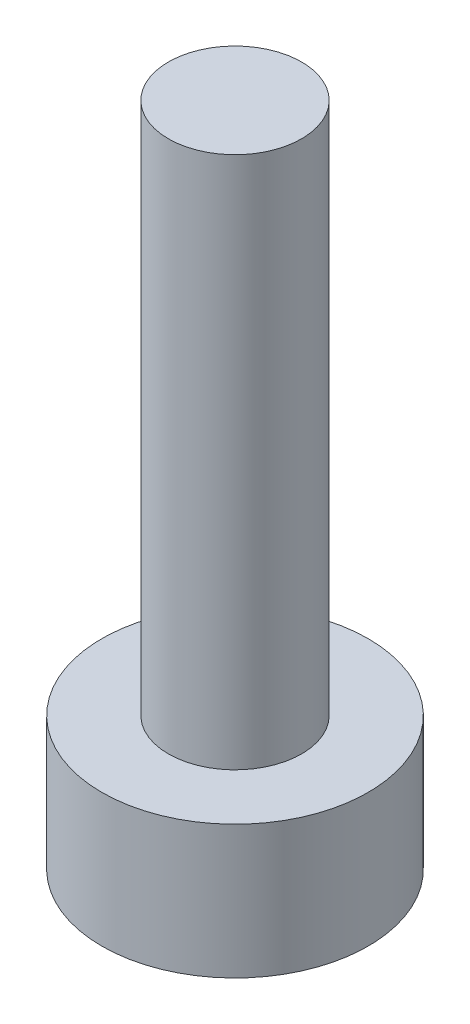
ISO-10303-21;
HEADER;
FILE_DESCRIPTION(('STEP AP214'),'2;1');
FILE_NAME('part.step','',(''),(''),'','','');
FILE_SCHEMA(('AUTOMOTIVE_DESIGN { 1 0 10303 214 1 1 1 1 }'));
ENDSEC;
DATA;
#1=APPLICATION_CONTEXT('core data for automotive mechanical design processes');
#2=APPLICATION_PROTOCOL_DEFINITION('international standard','automotive_design',2000,#1);
#3=PRODUCT_CONTEXT('',#1,'mechanical');
#4=PRODUCT('Part','Part','',(#3));
#5=PRODUCT_RELATED_PRODUCT_CATEGORY('part','',(#4));
#6=PRODUCT_DEFINITION_FORMATION('','',#4);
#7=PRODUCT_DEFINITION_CONTEXT('part definition',#1,'design');
#8=PRODUCT_DEFINITION('design','',#6,#7);
#9=PRODUCT_DEFINITION_SHAPE('','',#8);
#10=(LENGTH_UNIT() NAMED_UNIT(*) SI_UNIT(.MILLI.,.METRE.));
#11=(NAMED_UNIT(*) PLANE_ANGLE_UNIT() SI_UNIT($,.RADIAN.));
#12=(NAMED_UNIT(*) SI_UNIT($,.STERADIAN.) SOLID_ANGLE_UNIT());
#13=UNCERTAINTY_MEASURE_WITH_UNIT(LENGTH_MEASURE(1.E-05),#10,'distance_accuracy_value','');
#14=(GEOMETRIC_REPRESENTATION_CONTEXT(3) GLOBAL_UNCERTAINTY_ASSIGNED_CONTEXT((#13)) GLOBAL_UNIT_ASSIGNED_CONTEXT((#10,
#11,#12)) REPRESENTATION_CONTEXT('',''));
#15=CARTESIAN_POINT('',(0.,0.,0.));
#16=DIRECTION('',(0.,0.,1.));
#17=DIRECTION('',(1.,0.,0.));
#18=AXIS2_PLACEMENT_3D('',#15,#16,#17);
#19=CARTESIAN_POINT('',(-1.99999999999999,20.,0.));
#20=DIRECTION('',(0.,1.,0.));
#21=DIRECTION('',(0.,0.,1.));
#22=AXIS2_PLACEMENT_3D('',#19,#20,#21);
#23=PLANE('',#22);
#24=CARTESIAN_POINT('',(0.,20.,0.));
#25=DIRECTION('',(0.,1.,0.));
#26=DIRECTION('',(0.,0.,1.));
#27=AXIS2_PLACEMENT_3D('',#24,#25,#26);
#28=CIRCLE('',#27,1.99999999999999);
#29=CARTESIAN_POINT('',(0.,20.,1.99999999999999));
#30=VERTEX_POINT('',#29);
#31=EDGE_CURVE('E10',#30,#30,#28,.T.);
#32=ORIENTED_EDGE('',*,*,#31,.T.);
#33=EDGE_LOOP('',(#32));
#34=FACE_BOUND('',#33,.T.);
#35=ADVANCED_FACE('F30',(#34),#23,.T.);
#36=CARTESIAN_POINT('',(0.,49.4323076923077,0.));
#37=DIRECTION('',(0.,1.,0.));
#38=DIRECTION('',(0.,0.,1.));
#39=AXIS2_PLACEMENT_3D('',#36,#37,#38);
#40=CYLINDRICAL_SURFACE('',#39,1.99999999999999);
#41=CARTESIAN_POINT('',(0.,4.,0.));
#42=DIRECTION('',(0.,1.,0.));
#43=DIRECTION('',(0.,0.,1.));
#44=AXIS2_PLACEMENT_3D('',#41,#42,#43);
#45=CIRCLE('',#44,1.99999999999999);
#46=CARTESIAN_POINT('',(0.,4.,1.99999999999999));
#47=VERTEX_POINT('',#46);
#48=EDGE_CURVE('E36',#47,#47,#45,.T.);
#49=ORIENTED_EDGE('',*,*,#48,.T.);
#50=EDGE_LOOP('',(#49));
#51=FACE_BOUND('',#50,.T.);
#52=ORIENTED_EDGE('',*,*,#31,.F.);
#53=EDGE_LOOP('',(#52));
#54=FACE_BOUND('',#53,.T.);
#55=ADVANCED_FACE('F62',(#51,#54),#40,.T.);
#56=CARTESIAN_POINT('',(-3.99999999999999,4.,0.));
#57=DIRECTION('',(0.,1.,0.));
#58=DIRECTION('',(0.,0.,1.));
#59=AXIS2_PLACEMENT_3D('',#56,#57,#58);
#60=PLANE('',#59);
#61=CARTESIAN_POINT('',(0.,4.,0.));
#62=DIRECTION('',(0.,1.,0.));
#63=DIRECTION('',(0.,0.,1.));
#64=AXIS2_PLACEMENT_3D('',#61,#62,#63);
#65=CIRCLE('',#64,3.99999999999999);
#66=CARTESIAN_POINT('',(0.,4.,3.99999999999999));
#67=VERTEX_POINT('',#66);
#68=EDGE_CURVE('E40',#67,#67,#65,.T.);
#69=ORIENTED_EDGE('',*,*,#68,.T.);
#70=EDGE_LOOP('',(#69));
#71=FACE_BOUND('',#70,.T.);
#72=ORIENTED_EDGE('',*,*,#48,.F.);
#73=EDGE_LOOP('',(#72));
#74=FACE_BOUND('',#73,.T.);
#75=ADVANCED_FACE('F59',(#71,#74),#60,.T.);
#76=CARTESIAN_POINT('',(0.,49.4323076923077,0.));
#77=DIRECTION('',(0.,1.,0.));
#78=DIRECTION('',(0.,0.,1.));
#79=AXIS2_PLACEMENT_3D('',#76,#77,#78);
#80=CYLINDRICAL_SURFACE('',#79,3.99999999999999);
#81=CARTESIAN_POINT('',(0.,0.,0.));
#82=DIRECTION('',(0.,1.,0.));
#83=DIRECTION('',(0.,0.,1.));
#84=AXIS2_PLACEMENT_3D('',#81,#82,#83);
#85=CIRCLE('',#84,3.99999999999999);
#86=CARTESIAN_POINT('',(0.,0.,3.99999999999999));
#87=VERTEX_POINT('',#86);
#88=EDGE_CURVE('E44',#87,#87,#85,.T.);
#89=ORIENTED_EDGE('',*,*,#88,.T.);
#90=EDGE_LOOP('',(#89));
#91=FACE_BOUND('',#90,.T.);
#92=ORIENTED_EDGE('',*,*,#68,.F.);
#93=EDGE_LOOP('',(#92));
#94=FACE_BOUND('',#93,.T.);
#95=ADVANCED_FACE('F50',(#91,#94),#80,.T.);
#96=CARTESIAN_POINT('',(0.,0.,0.));
#97=DIRECTION('',(0.,-1.,0.));
#98=DIRECTION('',(0.,0.,-1.));
#99=AXIS2_PLACEMENT_3D('',#96,#97,#98);
#100=PLANE('',#99);
#101=ORIENTED_EDGE('',*,*,#88,.F.);
#102=EDGE_LOOP('',(#101));
#103=FACE_BOUND('',#102,.T.);
#104=ADVANCED_FACE('F53',(#103),#100,.T.);
#105=CLOSED_SHELL('',(#35,#55,#75,#95,#104));
#106=MANIFOLD_SOLID_BREP('B2',#105);
#107=ADVANCED_BREP_SHAPE_REPRESENTATION('',(#18,#106),#14);
#108=SHAPE_DEFINITION_REPRESENTATION(#9,#107);
ENDSEC;
END-ISO-10303-21;
